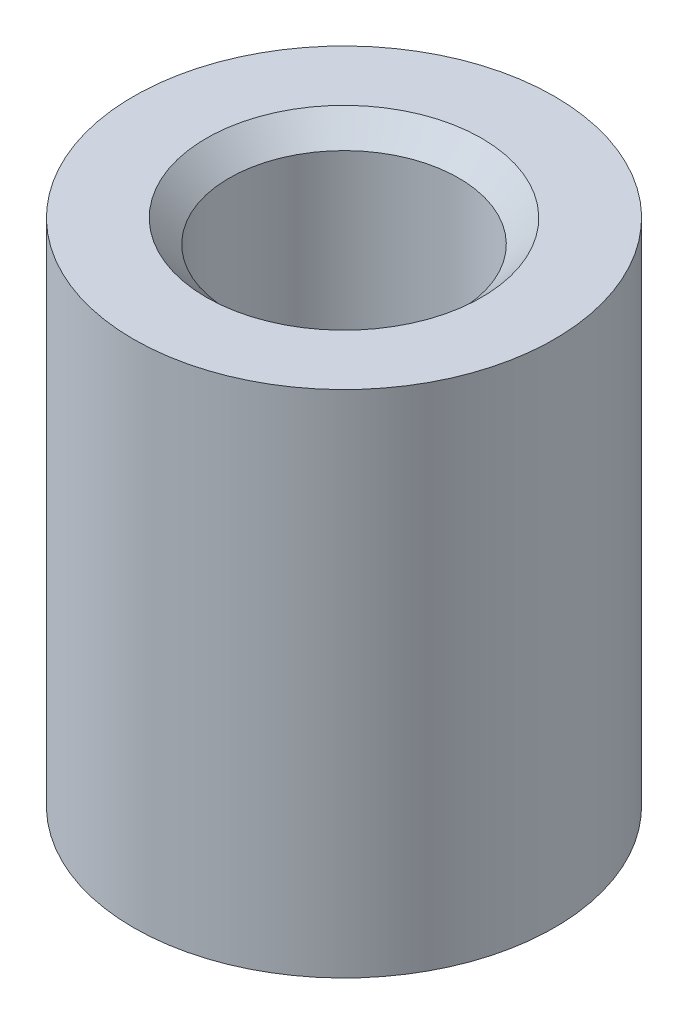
from build123d import *

# Parameters (mm, degrees)
SKETCH1_R           = 6.985
SKETCH1_R_2         = 3.81
BOSS_EXTRUDE1_DEPTH = 16.9164
CHAMFER1_SIZE       = 0.762


with BuildPart() as part:
    # Sketch1 → Boss-Extrude1 (new body)
    with BuildSketch(Plane(origin=(0, 0, 0), x_dir=(1, 0, 0), z_dir=(0, 1, 0))):
        with Locations(Location((0, 0, 0), (0, 0, 270))):
            Circle(SKETCH1_R)
        with Locations(Location((0, 0, 0), (0, 0, 270))):
            Circle(SKETCH1_R_2, mode=Mode.SUBTRACT)
    extrude(amount=BOSS_EXTRUDE1_DEPTH)

    # Chamfer1
    chamfer1_edges = [part.edges().sort_by_distance(p)[0] for p in [
        (0, 0, -3.81),
        (0, 16.9164, -3.81),
    ]]
    chamfer(chamfer1_edges, length=CHAMFER1_SIZE)


solid = part.part
